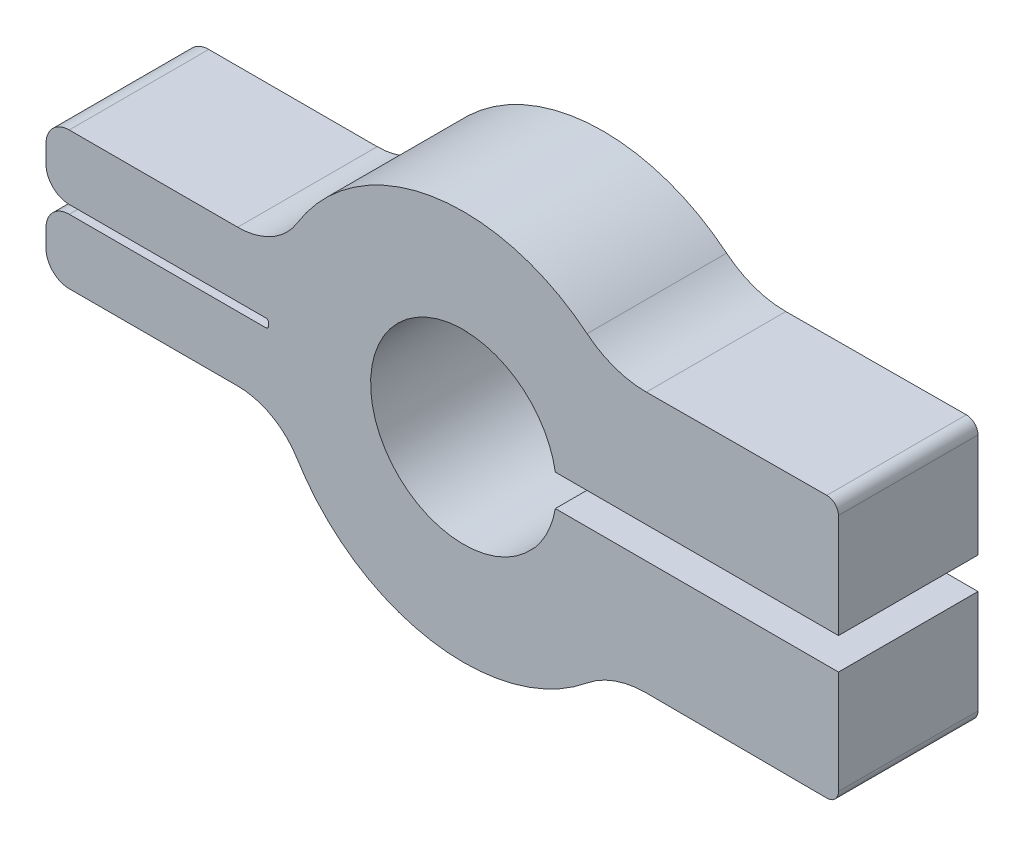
from build123d import *

# Parameters (mm, degrees)
BOSS_EXTRUDE1_DEPTH = 6
BOSS_EXTRUDE3_DEPTH = 6


with BuildPart() as part:
    # Sketch1 → Boss-Extrude1 (new body)
    with BuildSketch(Plane.XY):
        with BuildLine():
            Line((-216.861680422, 22.588222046), (-208.398797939, 22.588222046))
            ThreePointArc((-208.398797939, 22.588222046), (-208.327746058, 22.617854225), (-208.298802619, 22.689189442))
            ThreePointArc((-208.298802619, 22.689189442), (-208.299195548, 22.770422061), (-208.298802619, 22.85165468))
            ThreePointArc((-208.298802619, 22.85165468), (-208.327746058, 22.922989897), (-208.398797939, 22.952622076))
            Line((-208.398797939, 22.952622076), (-216.861680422, 22.952622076))
            ThreePointArc((-216.861680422, 22.952622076), (-217.568787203, 23.245515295), (-217.861680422, 23.952622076))
            Line((-217.861680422, 23.952622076), (-217.861680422, 24.727793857))
            ThreePointArc((-217.861680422, 24.727793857), (-217.568787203, 25.434900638), (-216.861680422, 25.727793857))
            Line((-216.861680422, 25.727793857), (-209.618237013, 25.727793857))
            ThreePointArc((-209.618237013, 25.727793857), (-208.152701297, 26.110122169), (-207.060709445, 27.159657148))
            ThreePointArc((-207.060709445, 27.159657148), (-201.306722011, 31.049157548), (-194.591861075, 29.275114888))
            ThreePointArc((-194.591861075, 29.275114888), (-193.396309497, 28.602697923), (-192.043882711, 28.373722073))
            Line((-192.043882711, 28.373722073), (-184.282501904, 28.409375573))
            ThreePointArc((-184.282501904, 28.409375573), (-183.927464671, 28.26374536), (-183.780205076, 27.909380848))
            Line((-183.780205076, 27.909380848), (-183.780205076, 25.606595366))
            ThreePointArc((-183.780205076, 25.606595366), (-183.926651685, 25.253041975), (-184.280205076, 25.106595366))
            Line((-184.280205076, 25.106595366), (-191.836639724, 25.106595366))
            Line((-191.836639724, 25.106595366), (-196.17791858, 25.106595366))
            ThreePointArc((-196.17791858, 25.106595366), (-196.585818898, 25.193568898), (-196.922766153, 25.439360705))
            ThreePointArc((-196.922766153, 25.439360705), (-203.902156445, 22.770422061), (-196.922766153, 20.101483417))
            ThreePointArc((-196.922766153, 20.101483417), (-196.585818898, 20.347275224), (-196.17791858, 20.434248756))
            Line((-196.17791858, 20.434248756), (-191.836639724, 20.434248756))
            Line((-191.836639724, 20.434248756), (-184.280205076, 20.434248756))
            ThreePointArc((-184.280205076, 20.434248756), (-183.926651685, 20.287802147), (-183.780205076, 19.934248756))
            Line((-183.780205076, 19.934248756), (-183.780205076, 17.631463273))
            ThreePointArc((-183.780205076, 17.631463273), (-183.927464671, 17.277098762), (-184.282501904, 17.131468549))
            Line((-184.282501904, 17.131468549), (-192.043882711, 17.167122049))
            ThreePointArc((-192.043882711, 17.167122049), (-193.396309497, 16.938146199), (-194.591861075, 16.265729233))
            ThreePointArc((-194.591861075, 16.265729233), (-201.306722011, 14.491686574), (-207.060709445, 18.381186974))
            ThreePointArc((-207.060709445, 18.381186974), (-208.152701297, 19.430721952), (-209.618237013, 19.813050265))
            Line((-209.618237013, 19.813050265), (-216.861680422, 19.813050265))
            ThreePointArc((-216.861680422, 19.813050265), (-217.568787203, 20.105943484), (-217.861680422, 20.813050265))
            Line((-217.861680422, 20.813050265), (-217.861680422, 21.588222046))
            ThreePointArc((-217.861680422, 21.588222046), (-217.568787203, 22.295328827), (-216.861680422, 22.588222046))
        make_face()
    extrude(amount=BOSS_EXTRUDE1_DEPTH)

    # Sketch2 → Boss-Extrude3 (add)
    with BuildSketch(Plane.XY.offset(6)):
        with BuildLine():
            Line((-195.95703338, 23.43644067), (-183.780205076, 23.43644067))
            Line((-183.780205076, 23.43644067), (-183.780205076, 26.757988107))
            Line((-183.780205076, 26.757988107), (-199.899076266, 26.757988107))
            ThreePointArc((-199.899076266, 26.757988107), (-197.321656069, 25.816893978), (-195.95703338, 23.43644067))
        make_face()
        with BuildLine():
            Line((-183.780205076, 22.079535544), (-183.780205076, 18.757988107))
            Line((-183.780205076, 18.757988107), (-199.899076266, 18.757988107))
            ThreePointArc((-199.899076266, 18.757988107), (-197.321656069, 19.699082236), (-195.95703338, 22.079535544))
            Line((-195.95703338, 22.079535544), (-183.780205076, 22.079535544))
        make_face()
    extrude(amount=-BOSS_EXTRUDE3_DEPTH)


solid = part.part
